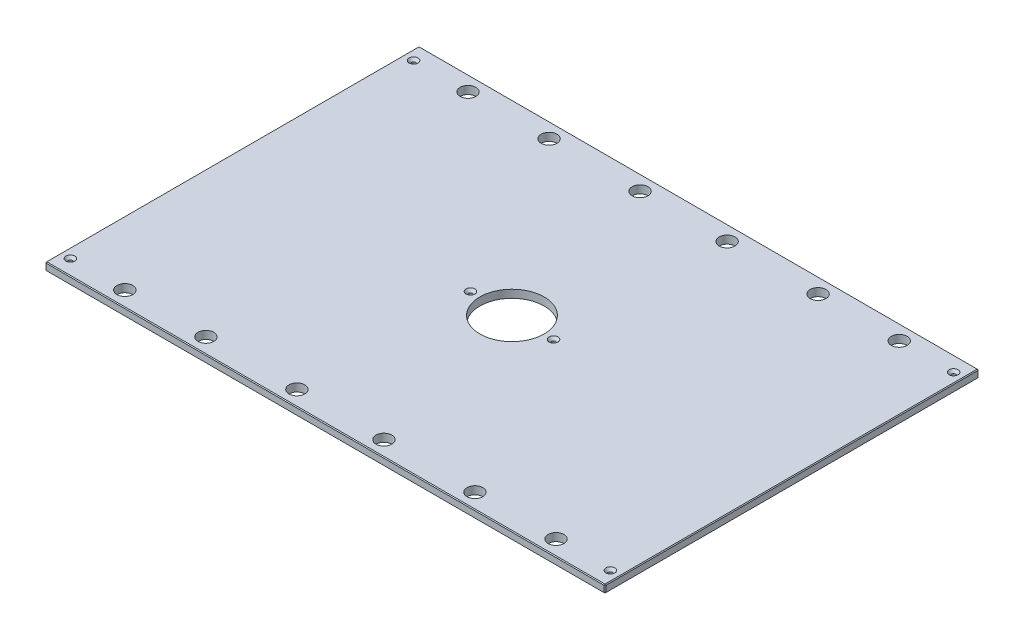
from build123d import *

# Parameters (mm, degrees)
SKETCH1_W                                        = 898.525
SKETCH1_H                                        = 600.075
BOSS_EXTRUDE1_DEPTH                              = 12.7
SKETCH13_R                                       = 51.562
CUT_EXTRUDE6_DEPTH                               = 541.389290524
F_1_1_DIAMETER_HOLE1_D                           = 25.4
CHAMFER2_SIZE                                    = 1.27
CSK_FOR_1_4_FLAT_HEAD_MACHINE_SCREW1_D           = 6.7564
CSK_FOR_1_4_FLAT_HEAD_MACHINE_SCREW1_CSINK_D     = 14.2748
CSK_FOR_1_4_FLAT_HEAD_MACHINE_SCREW1_CSINK_ANGLE = 82


with BuildPart() as part:
    # Sketch1 → Boss-Extrude1 (new body)
    with BuildSketch(Plane(origin=(0, 0, 0), x_dir=(1, 0, 0), z_dir=(0, 1, 0))):
        Rectangle(SKETCH1_W, SKETCH1_H)
    extrude(amount=BOSS_EXTRUDE1_DEPTH)

    # Sketch13 → Cut-Extrude6 (cut, through all)
    with BuildSketch(Plane(origin=(0, 12.7, 0), x_dir=(1, 0, 0), z_dir=(0, 1, 0))):
        with Locations(Location((0, 0, 0), (0, 0, 270))):
            Circle(SKETCH13_R)
    extrude(amount=-CUT_EXTRUDE6_DEPTH, mode=Mode.SUBTRACT)

    # 1 _1_ Diameter Hole1 (through all)
    with Locations(Plane(origin=(0, 12.7, 0), x_dir=(1, 0, 0), z_dir=(0, 1, 0))):
        with Locations((346.075, 275.42998), (-346.075, 275.42998), (346.075, -275.42998), (-346.075, -275.42998), (-215.9, 275.42998), (215.9, 275.42998), (215.9, -275.42998), (-215.9, -275.42998), (69.85, 275.42998), (-69.85, 275.42998), (-69.85, -275.42998), (69.85, -275.42998)):
            Hole(F_1_1_DIAMETER_HOLE1_D / 2)

    # Chamfer2
    chamfer2_edges = [part.edges().sort_by_distance(p)[0] for p in [
        (449.2625, 12.7, 0),
        (0, 12.7, -300.0375),
        (-449.2625, 12.7, 0),
        (0, 0, -300.0375),
        (449.2625, 0, 0),
        (0, 0, 300.0375),
        (-449.2625, 0, 0),
        (0, 12.7, 300.0375),
        (-449.2625, 6.35, -300.0375),
        (449.2625, 6.35, -300.0375),
        (449.2625, 6.35, 300.0375),
        (-449.2625, 6.35, 300.0375),
    ]]
    chamfer(chamfer2_edges, length=CHAMFER2_SIZE)

    # CSK for 1_4 Flat Head Machine Screw1 (through all)
    with Locations(Plane(origin=(0, 12.7, 0), x_dir=(1, 0, 0), z_dir=(0, 1, 0))):
        with Locations((433.3875, 275.42998), (433.3875, -275.42998), (-433.3875, -275.42998), (-66.675, 0), (66.675, 0), (-433.3875, 275.42998), (-346.075, 275.42998), (-346.075, -275.42998)):
            CounterSinkHole(CSK_FOR_1_4_FLAT_HEAD_MACHINE_SCREW1_D / 2, CSK_FOR_1_4_FLAT_HEAD_MACHINE_SCREW1_CSINK_D / 2, counter_sink_angle=CSK_FOR_1_4_FLAT_HEAD_MACHINE_SCREW1_CSINK_ANGLE)


solid = part.part
